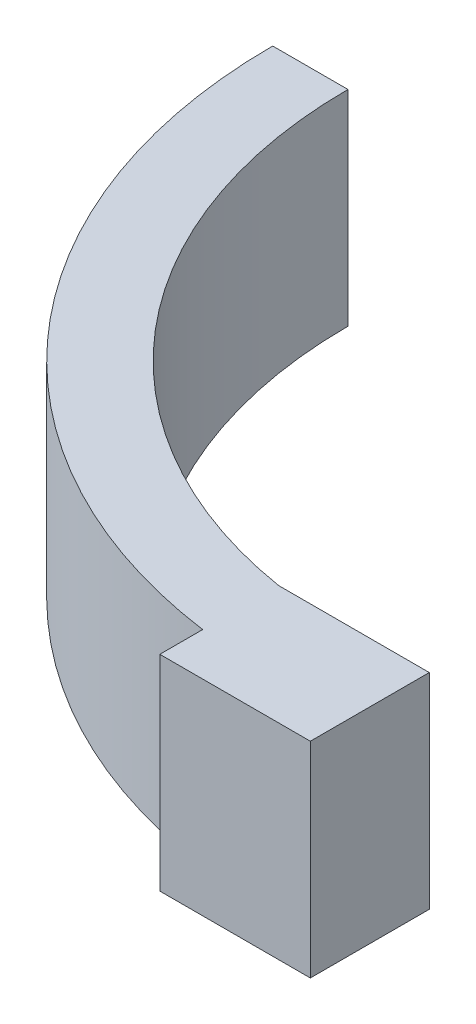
from build123d import *

# Parameters (mm, degrees)
BOSS_EXTRUDE2_DEPTH     = 54.5
CUT_EXTRUDE1_DEPTH      = 320.992578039
CUT_EXTRUDE1_DEPTH_BACK = 320.992578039
SKETCH3_W               = 203.108733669
SKETCH3_H               = 171.373523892
SKETCH4_W               = 15
SKETCH4_H               = 8
CUT_EXTRUDE2_DEPTH      = 10


with BuildPart() as part:
    # Sketch2 → Boss-Extrude2 (new body)
    with BuildSketch(Plane(origin=(0, 0, 0), x_dir=(1, 0, 0), z_dir=(0, 1, 0))):
        with BuildLine():
            Line((20, 280), (-20, 280))
            Line((-20, 280), (-20, 268.614066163))
            ThreePointArc((-20, 268.614066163), (-145, 125), (-20, -18.614066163))
            Line((-20, -18.614066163), (-20, -30))
            Line((-20, -30), (20, -30))
            Line((20, -30), (20, 0))
            Line((20, 0), (20, 1.610373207))
            Line((20, 1.610373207), (-20, 1.610373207))
            ThreePointArc((-20, 1.610373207), (-125, 125), (-20, 248.389626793))
            Line((-20, 248.389626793), (20, 248.389626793))
            Line((20, 248.389626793), (20, 280))
        make_face()
    extrude(amount=BOSS_EXTRUDE2_DEPTH)

    # Sketch3 → Cut-Extrude1 (cut, two sides: drawn at the far end of the back side and taken through both)
    with BuildSketch(Plane(origin=(0, 54.5, 0), x_dir=(1, 0, 0), z_dir=(0, 1, 0)).offset(-CUT_EXTRUDE1_DEPTH_BACK)):
        with Locations((-43.445633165, 210.686761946)):
            Rectangle(SKETCH3_W, SKETCH3_H)
    extrude(amount=CUT_EXTRUDE1_DEPTH + CUT_EXTRUDE1_DEPTH_BACK, mode=Mode.SUBTRACT)

    # Sketch4 → Cut-Extrude2 (cut)
    with BuildSketch(Plane(origin=(0, 0, -125), x_dir=(-1, 0, 0), z_dir=(0, 0, -1))):
        with Locations((135, 23.2500015)):
            Rectangle(SKETCH4_W, SKETCH4_H)
        with Locations((135, 31.2500015)):
            Rectangle(SKETCH4_W, SKETCH4_H)
    extrude(amount=-CUT_EXTRUDE2_DEPTH, mode=Mode.SUBTRACT)


solid = part.part
